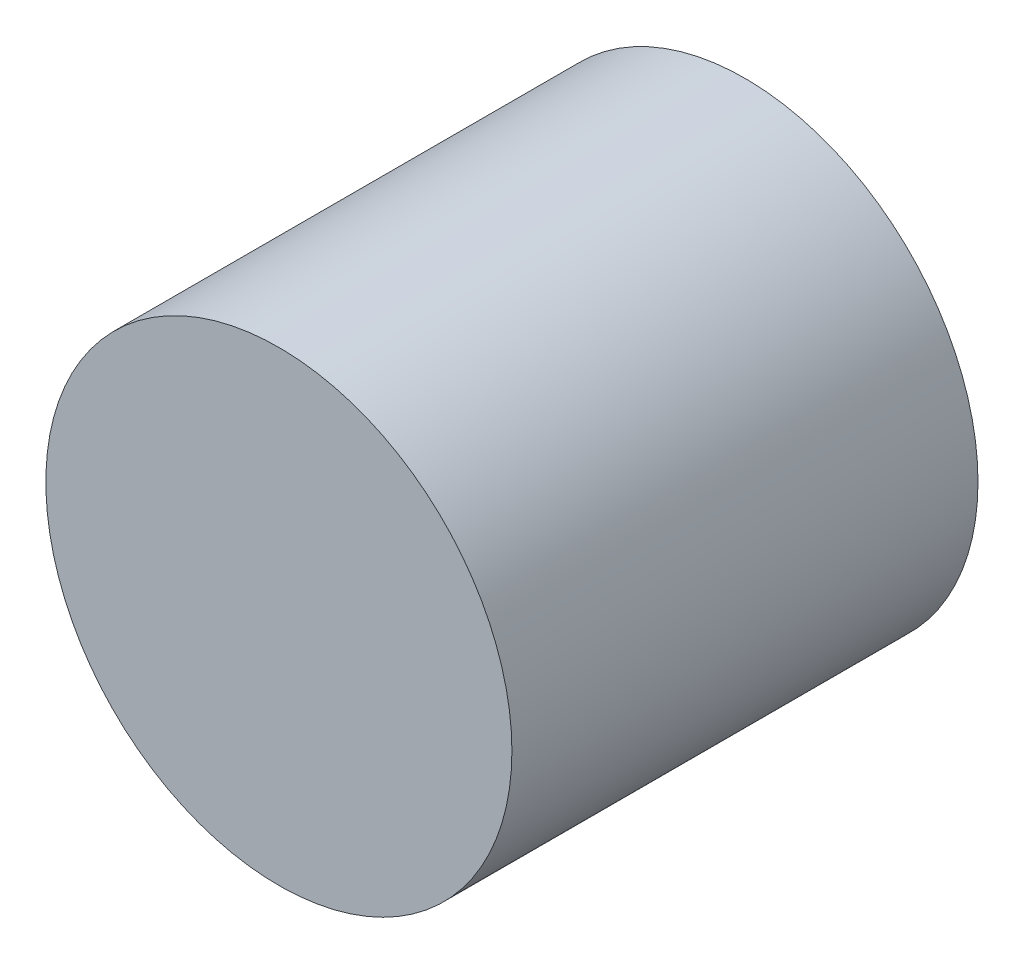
ISO-10303-21;
HEADER;
FILE_DESCRIPTION(('STEP AP214'),'2;1');
FILE_NAME('part.step','',(''),(''),'','','');
FILE_SCHEMA(('AUTOMOTIVE_DESIGN { 1 0 10303 214 1 1 1 1 }'));
ENDSEC;
DATA;
#1=APPLICATION_CONTEXT('core data for automotive mechanical design processes');
#2=APPLICATION_PROTOCOL_DEFINITION('international standard','automotive_design',2000,#1);
#3=PRODUCT_CONTEXT('',#1,'mechanical');
#4=PRODUCT('Part','Part','',(#3));
#5=PRODUCT_RELATED_PRODUCT_CATEGORY('part','',(#4));
#6=PRODUCT_DEFINITION_FORMATION('','',#4);
#7=PRODUCT_DEFINITION_CONTEXT('part definition',#1,'design');
#8=PRODUCT_DEFINITION('design','',#6,#7);
#9=PRODUCT_DEFINITION_SHAPE('','',#8);
#10=(LENGTH_UNIT() NAMED_UNIT(*) SI_UNIT(.MILLI.,.METRE.));
#11=(NAMED_UNIT(*) PLANE_ANGLE_UNIT() SI_UNIT($,.RADIAN.));
#12=(NAMED_UNIT(*) SI_UNIT($,.STERADIAN.) SOLID_ANGLE_UNIT());
#13=UNCERTAINTY_MEASURE_WITH_UNIT(LENGTH_MEASURE(1.E-05),#10,'distance_accuracy_value','');
#14=(GEOMETRIC_REPRESENTATION_CONTEXT(3) GLOBAL_UNCERTAINTY_ASSIGNED_CONTEXT((#13)) GLOBAL_UNIT_ASSIGNED_CONTEXT((#10,
#11,#12)) REPRESENTATION_CONTEXT('',''));
#15=CARTESIAN_POINT('',(0.,0.,0.));
#16=DIRECTION('',(0.,0.,1.));
#17=DIRECTION('',(1.,0.,0.));
#18=AXIS2_PLACEMENT_3D('',#15,#16,#17);
#19=CARTESIAN_POINT('',(0.,0.,30.));
#20=DIRECTION('',(0.,0.,-1.));
#21=DIRECTION('',(-1.,0.,0.));
#22=AXIS2_PLACEMENT_3D('',#19,#20,#21);
#23=CYLINDRICAL_SURFACE('',#22,15.);
#24=CARTESIAN_POINT('',(0.,0.,30.));
#25=DIRECTION('',(0.,0.,1.));
#26=DIRECTION('',(1.,0.,0.));
#27=AXIS2_PLACEMENT_3D('',#24,#25,#26);
#28=CIRCLE('',#27,15.);
#29=CARTESIAN_POINT('',(15.,0.,30.));
#30=VERTEX_POINT('',#29);
#31=EDGE_CURVE('E10',#30,#30,#28,.T.);
#32=ORIENTED_EDGE('',*,*,#31,.F.);
#33=EDGE_LOOP('',(#32));
#34=FACE_BOUND('',#33,.T.);
#35=CARTESIAN_POINT('',(0.,0.,0.));
#36=DIRECTION('',(0.,0.,1.));
#37=DIRECTION('',(1.,0.,0.));
#38=AXIS2_PLACEMENT_3D('',#35,#36,#37);
#39=CIRCLE('',#38,15.);
#40=CARTESIAN_POINT('',(15.,0.,0.));
#41=VERTEX_POINT('',#40);
#42=EDGE_CURVE('E34',#41,#41,#39,.T.);
#43=ORIENTED_EDGE('',*,*,#42,.T.);
#44=EDGE_LOOP('',(#43));
#45=FACE_BOUND('',#44,.T.);
#46=ADVANCED_FACE('F31',(#34,#45),#23,.T.);
#47=CARTESIAN_POINT('',(0.,0.,30.));
#48=DIRECTION('',(0.,0.,1.));
#49=DIRECTION('',(1.,0.,0.));
#50=AXIS2_PLACEMENT_3D('',#47,#48,#49);
#51=PLANE('',#50);
#52=ORIENTED_EDGE('',*,*,#31,.T.);
#53=EDGE_LOOP('',(#52));
#54=FACE_BOUND('',#53,.T.);
#55=ADVANCED_FACE('F46',(#54),#51,.T.);
#56=CARTESIAN_POINT('',(0.,0.,0.));
#57=DIRECTION('',(0.,0.,1.));
#58=DIRECTION('',(1.,0.,0.));
#59=AXIS2_PLACEMENT_3D('',#56,#57,#58);
#60=PLANE('',#59);
#61=ORIENTED_EDGE('',*,*,#42,.F.);
#62=EDGE_LOOP('',(#61));
#63=FACE_BOUND('',#62,.T.);
#64=ADVANCED_FACE('F44',(#63),#60,.F.);
#65=CLOSED_SHELL('',(#46,#55,#64));
#66=MANIFOLD_SOLID_BREP('B2',#65);
#67=ADVANCED_BREP_SHAPE_REPRESENTATION('',(#18,#66),#14);
#68=SHAPE_DEFINITION_REPRESENTATION(#9,#67);
ENDSEC;
END-ISO-10303-21;
